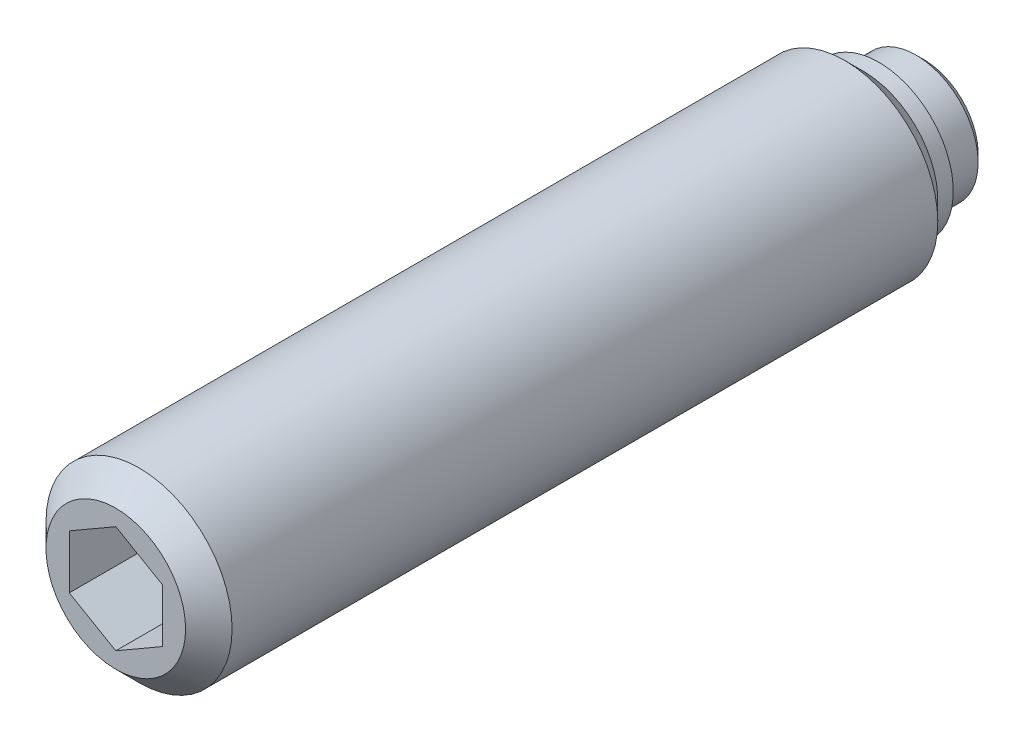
ISO-10303-21;
HEADER;
FILE_DESCRIPTION(('STEP AP214'),'2;1');
FILE_NAME('part.step','',(''),(''),'','','');
FILE_SCHEMA(('AUTOMOTIVE_DESIGN { 1 0 10303 214 1 1 1 1 }'));
ENDSEC;
DATA;
#1=APPLICATION_CONTEXT('core data for automotive mechanical design processes');
#2=APPLICATION_PROTOCOL_DEFINITION('international standard','automotive_design',2000,#1);
#3=PRODUCT_CONTEXT('',#1,'mechanical');
#4=PRODUCT('Part','Part','',(#3));
#5=PRODUCT_RELATED_PRODUCT_CATEGORY('part','',(#4));
#6=PRODUCT_DEFINITION_FORMATION('','',#4);
#7=PRODUCT_DEFINITION_CONTEXT('part definition',#1,'design');
#8=PRODUCT_DEFINITION('design','',#6,#7);
#9=PRODUCT_DEFINITION_SHAPE('','',#8);
#10=(LENGTH_UNIT() NAMED_UNIT(*) SI_UNIT(.MILLI.,.METRE.));
#11=(NAMED_UNIT(*) PLANE_ANGLE_UNIT() SI_UNIT($,.RADIAN.));
#12=(NAMED_UNIT(*) SI_UNIT($,.STERADIAN.) SOLID_ANGLE_UNIT());
#13=UNCERTAINTY_MEASURE_WITH_UNIT(LENGTH_MEASURE(1.E-05),#10,'distance_accuracy_value','');
#14=(GEOMETRIC_REPRESENTATION_CONTEXT(3) GLOBAL_UNCERTAINTY_ASSIGNED_CONTEXT((#13)) GLOBAL_UNIT_ASSIGNED_CONTEXT((#10,
#11,#12)) REPRESENTATION_CONTEXT('',''));
#15=CARTESIAN_POINT('',(0.,0.,0.));
#16=DIRECTION('',(0.,0.,1.));
#17=DIRECTION('',(1.,0.,0.));
#18=AXIS2_PLACEMENT_3D('',#15,#16,#17);
#19=CARTESIAN_POINT('',(0.,0.,0.));
#20=DIRECTION('',(0.,0.,-1.));
#21=DIRECTION('',(-1.,0.,0.));
#22=AXIS2_PLACEMENT_3D('',#19,#20,#21);
#23=CYLINDRICAL_SURFACE('',#22,4.);
#24=CARTESIAN_POINT('',(0.,0.,0.5));
#25=DIRECTION('',(0.,0.,-1.));
#26=DIRECTION('',(-1.,0.,0.));
#27=AXIS2_PLACEMENT_3D('',#24,#25,#26);
#28=CIRCLE('',#27,4.);
#29=CARTESIAN_POINT('',(-4.,0.,0.5));
#30=VERTEX_POINT('',#29);
#31=EDGE_CURVE('E133',#30,#30,#28,.T.);
#32=ORIENTED_EDGE('',*,*,#31,.F.);
#33=EDGE_LOOP('',(#32));
#34=FACE_BOUND('',#33,.T.);
#35=CARTESIAN_POINT('',(0.,0.,2.9));
#36=DIRECTION('',(0.,0.,-1.));
#37=DIRECTION('',(-1.,0.,0.));
#38=AXIS2_PLACEMENT_3D('',#35,#36,#37);
#39=CIRCLE('',#38,4.);
#40=CARTESIAN_POINT('',(-4.,0.,2.9));
#41=VERTEX_POINT('',#40);
#42=EDGE_CURVE('E127',#41,#41,#39,.T.);
#43=ORIENTED_EDGE('',*,*,#42,.T.);
#44=EDGE_LOOP('',(#43));
#45=FACE_BOUND('',#44,.T.);
#46=ADVANCED_FACE('F14',(#34,#45),#23,.T.);
#47=CARTESIAN_POINT('',(0.,0.,0.5));
#48=DIRECTION('',(0.,0.,1.));
#49=DIRECTION('',(1.,0.,0.));
#50=AXIS2_PLACEMENT_3D('',#47,#48,#49);
#51=CONICAL_SURFACE('',#50,4.,0.785398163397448);
#52=CARTESIAN_POINT('',(0.,0.,0.));
#53=DIRECTION('',(0.,0.,-1.));
#54=DIRECTION('',(-1.,0.,0.));
#55=AXIS2_PLACEMENT_3D('',#52,#53,#54);
#56=CIRCLE('',#55,3.5);
#57=CARTESIAN_POINT('',(-3.5,0.,0.));
#58=VERTEX_POINT('',#57);
#59=EDGE_CURVE('E130',#58,#58,#56,.T.);
#60=ORIENTED_EDGE('',*,*,#59,.F.);
#61=EDGE_LOOP('',(#60));
#62=FACE_BOUND('',#61,.T.);
#63=ORIENTED_EDGE('',*,*,#31,.T.);
#64=EDGE_LOOP('',(#63));
#65=FACE_BOUND('',#64,.T.);
#66=ADVANCED_FACE('F159',(#62,#65),#51,.T.);
#67=CARTESIAN_POINT('',(0.,3.5,0.));
#68=DIRECTION('',(0.,0.,1.));
#69=DIRECTION('',(1.,0.,0.));
#70=AXIS2_PLACEMENT_3D('',#67,#68,#69);
#71=PLANE('',#70);
#72=ORIENTED_EDGE('',*,*,#59,.T.);
#73=EDGE_LOOP('',(#72));
#74=FACE_BOUND('',#73,.T.);
#75=ADVANCED_FACE('F165',(#74),#71,.F.);
#76=CARTESIAN_POINT('',(0.,0.,2.9));
#77=DIRECTION('',(0.,0.,-1.));
#78=DIRECTION('',(-1.,0.,0.));
#79=AXIS2_PLACEMENT_3D('',#76,#77,#78);
#80=CYLINDRICAL_SURFACE('',#79,6.);
#81=CARTESIAN_POINT('',(0.,0.,5.1));
#82=DIRECTION('',(0.,0.,-1.));
#83=DIRECTION('',(-1.,0.,0.));
#84=AXIS2_PLACEMENT_3D('',#81,#82,#83);
#85=CIRCLE('',#84,6.);
#86=CARTESIAN_POINT('',(-6.,0.,5.1));
#87=VERTEX_POINT('',#86);
#88=EDGE_CURVE('E9',#87,#87,#85,.T.);
#89=ORIENTED_EDGE('',*,*,#88,.F.);
#90=EDGE_LOOP('',(#89));
#91=FACE_BOUND('',#90,.T.);
#92=CARTESIAN_POINT('',(0.,0.,50.6));
#93=DIRECTION('',(0.,0.,1.));
#94=DIRECTION('',(1.,0.,0.));
#95=AXIS2_PLACEMENT_3D('',#92,#93,#94);
#96=CIRCLE('',#95,6.);
#97=CARTESIAN_POINT('',(6.,0.,50.6));
#98=VERTEX_POINT('',#97);
#99=EDGE_CURVE('E124',#98,#98,#96,.T.);
#100=ORIENTED_EDGE('',*,*,#99,.F.);
#101=EDGE_LOOP('',(#100));
#102=FACE_BOUND('',#101,.T.);
#103=ADVANCED_FACE('F16',(#91,#102),#80,.T.);
#104=CARTESIAN_POINT('',(0.,4.8,2.9));
#105=DIRECTION('',(0.,0.,1.));
#106=DIRECTION('',(1.,0.,0.));
#107=AXIS2_PLACEMENT_3D('',#104,#105,#106);
#108=PLANE('',#107);
#109=CARTESIAN_POINT('',(0.,0.,2.9));
#110=DIRECTION('',(0.,0.,-1.));
#111=DIRECTION('',(-1.,0.,0.));
#112=AXIS2_PLACEMENT_3D('',#109,#110,#111);
#113=CIRCLE('',#112,4.8);
#114=CARTESIAN_POINT('',(-4.8,0.,2.9));
#115=VERTEX_POINT('',#114);
#116=EDGE_CURVE('E136',#115,#115,#113,.T.);
#117=ORIENTED_EDGE('',*,*,#116,.T.);
#118=EDGE_LOOP('',(#117));
#119=FACE_BOUND('',#118,.T.);
#120=ORIENTED_EDGE('',*,*,#42,.F.);
#121=EDGE_LOOP('',(#120));
#122=FACE_BOUND('',#121,.T.);
#123=ADVANCED_FACE('F156',(#119,#122),#108,.F.);
#124=CARTESIAN_POINT('',(0.,0.,2.9));
#125=DIRECTION('',(0.,0.,-1.));
#126=DIRECTION('',(-1.,0.,0.));
#127=AXIS2_PLACEMENT_3D('',#124,#125,#126);
#128=CYLINDRICAL_SURFACE('',#127,4.8);
#129=CARTESIAN_POINT('',(0.,0.,3.9));
#130=DIRECTION('',(0.,0.,-1.));
#131=DIRECTION('',(-1.,0.,0.));
#132=AXIS2_PLACEMENT_3D('',#129,#130,#131);
#133=CIRCLE('',#132,4.8);
#134=CARTESIAN_POINT('',(-4.8,0.,3.9));
#135=VERTEX_POINT('',#134);
#136=EDGE_CURVE('E22',#135,#135,#133,.T.);
#137=ORIENTED_EDGE('',*,*,#136,.T.);
#138=EDGE_LOOP('',(#137));
#139=FACE_BOUND('',#138,.T.);
#140=ORIENTED_EDGE('',*,*,#116,.F.);
#141=EDGE_LOOP('',(#140));
#142=FACE_BOUND('',#141,.T.);
#143=ADVANCED_FACE('F141',(#139,#142),#128,.T.);
#144=CARTESIAN_POINT('',(0.,0.,5.1));
#145=DIRECTION('',(0.,0.,1.));
#146=DIRECTION('',(1.,0.,0.));
#147=AXIS2_PLACEMENT_3D('',#144,#145,#146);
#148=CONICAL_SURFACE('',#147,6.,0.785398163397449);
#149=ORIENTED_EDGE('',*,*,#88,.T.);
#150=EDGE_LOOP('',(#149));
#151=FACE_BOUND('',#150,.T.);
#152=ORIENTED_EDGE('',*,*,#136,.F.);
#153=EDGE_LOOP('',(#152));
#154=FACE_BOUND('',#153,.T.);
#155=ADVANCED_FACE('F144',(#151,#154),#148,.T.);
#156=CARTESIAN_POINT('',(0.,-4.5,52.1));
#157=DIRECTION('',(0.,0.,1.));
#158=DIRECTION('',(1.,0.,0.));
#159=AXIS2_PLACEMENT_3D('',#156,#157,#158);
#160=PLANE('',#159);
#161=DIRECTION('',(0.866025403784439,-0.5,0.));
#162=VECTOR('',#161,1.);
#163=CARTESIAN_POINT('',(-3.,-1.73205080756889,52.1));
#164=LINE('',#163,#162);
#165=CARTESIAN_POINT('',(-3.,-1.73205080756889,52.1));
#166=VERTEX_POINT('',#165);
#167=CARTESIAN_POINT('',(0.,-3.46410161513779,52.1));
#168=VERTEX_POINT('',#167);
#169=EDGE_CURVE('E29',#166,#168,#164,.T.);
#170=ORIENTED_EDGE('',*,*,#169,.F.);
#171=DIRECTION('',(0.,-1.,0.));
#172=VECTOR('',#171,1.);
#173=CARTESIAN_POINT('',(-3.,1.73205080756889,52.1));
#174=LINE('',#173,#172);
#175=CARTESIAN_POINT('',(-3.,1.73205080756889,52.1));
#176=VERTEX_POINT('',#175);
#177=EDGE_CURVE('E112',#176,#166,#174,.T.);
#178=ORIENTED_EDGE('',*,*,#177,.F.);
#179=DIRECTION('',(-0.866025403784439,-0.5,0.));
#180=VECTOR('',#179,1.);
#181=CARTESIAN_POINT('',(0.,3.46410161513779,52.1));
#182=LINE('',#181,#180);
#183=CARTESIAN_POINT('',(0.,3.46410161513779,52.1));
#184=VERTEX_POINT('',#183);
#185=EDGE_CURVE('E110',#184,#176,#182,.T.);
#186=ORIENTED_EDGE('',*,*,#185,.F.);
#187=DIRECTION('',(-0.866025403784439,0.5,0.));
#188=VECTOR('',#187,1.);
#189=CARTESIAN_POINT('',(3.,1.73205080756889,52.1));
#190=LINE('',#189,#188);
#191=CARTESIAN_POINT('',(3.,1.73205080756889,52.1));
#192=VERTEX_POINT('',#191);
#193=EDGE_CURVE('E77',#192,#184,#190,.T.);
#194=ORIENTED_EDGE('',*,*,#193,.F.);
#195=DIRECTION('',(0.,1.,0.));
#196=VECTOR('',#195,1.);
#197=CARTESIAN_POINT('',(3.,-1.73205080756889,52.1));
#198=LINE('',#197,#196);
#199=CARTESIAN_POINT('',(3.,-1.73205080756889,52.1));
#200=VERTEX_POINT('',#199);
#201=EDGE_CURVE('E106',#200,#192,#198,.T.);
#202=ORIENTED_EDGE('',*,*,#201,.F.);
#203=DIRECTION('',(0.866025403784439,0.5,0.));
#204=VECTOR('',#203,1.);
#205=CARTESIAN_POINT('',(0.,-3.46410161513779,52.1));
#206=LINE('',#205,#204);
#207=EDGE_CURVE('E103',#168,#200,#206,.T.);
#208=ORIENTED_EDGE('',*,*,#207,.F.);
#209=EDGE_LOOP('',(#170,#178,#186,#194,#202,#208));
#210=FACE_BOUND('',#209,.T.);
#211=CARTESIAN_POINT('',(0.,0.,52.1));
#212=DIRECTION('',(0.,0.,1.));
#213=DIRECTION('',(1.,0.,0.));
#214=AXIS2_PLACEMENT_3D('',#211,#212,#213);
#215=CIRCLE('',#214,4.5);
#216=CARTESIAN_POINT('',(4.5,0.,52.1));
#217=VERTEX_POINT('',#216);
#218=EDGE_CURVE('E116',#217,#217,#215,.T.);
#219=ORIENTED_EDGE('',*,*,#218,.T.);
#220=EDGE_LOOP('',(#219));
#221=FACE_BOUND('',#220,.T.);
#222=ADVANCED_FACE('F146',(#210,#221),#160,.T.);
#223=CARTESIAN_POINT('',(0.,0.,52.1));
#224=DIRECTION('',(0.,0.,-1.));
#225=DIRECTION('',(-1.,0.,0.));
#226=AXIS2_PLACEMENT_3D('',#223,#224,#225);
#227=CONICAL_SURFACE('',#226,4.5,0.78539816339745);
#228=ORIENTED_EDGE('',*,*,#99,.T.);
#229=EDGE_LOOP('',(#228));
#230=FACE_BOUND('',#229,.T.);
#231=ORIENTED_EDGE('',*,*,#218,.F.);
#232=EDGE_LOOP('',(#231));
#233=FACE_BOUND('',#232,.T.);
#234=ADVANCED_FACE('F153',(#230,#233),#227,.T.);
#235=CARTESIAN_POINT('',(-3.,-1.73205080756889,44.1));
#236=DIRECTION('',(-0.5,-0.866025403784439,0.));
#237=DIRECTION('',(0.866025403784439,-0.5,0.));
#238=AXIS2_PLACEMENT_3D('',#235,#236,#237);
#239=PLANE('',#238);
#240=ORIENTED_EDGE('',*,*,#169,.T.);
#241=DIRECTION('',(0.,0.,1.));
#242=VECTOR('',#241,1.);
#243=CARTESIAN_POINT('',(0.,-3.46410161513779,44.1));
#244=LINE('',#243,#242);
#245=CARTESIAN_POINT('',(0.,-3.46410161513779,44.1));
#246=VERTEX_POINT('',#245);
#247=EDGE_CURVE('E59',#246,#168,#244,.T.);
#248=ORIENTED_EDGE('',*,*,#247,.F.);
#249=DIRECTION('',(0.866025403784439,-0.5,0.));
#250=VECTOR('',#249,1.);
#251=CARTESIAN_POINT('',(-3.,-1.73205080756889,44.1));
#252=LINE('',#251,#250);
#253=CARTESIAN_POINT('',(-3.,-1.73205080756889,44.1));
#254=VERTEX_POINT('',#253);
#255=EDGE_CURVE('E114',#254,#246,#252,.T.);
#256=ORIENTED_EDGE('',*,*,#255,.F.);
#257=DIRECTION('',(0.,0.,1.));
#258=VECTOR('',#257,1.);
#259=CARTESIAN_POINT('',(-3.,-1.73205080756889,44.1));
#260=LINE('',#259,#258);
#261=EDGE_CURVE('E37',#254,#166,#260,.T.);
#262=ORIENTED_EDGE('',*,*,#261,.T.);
#263=EDGE_LOOP('',(#240,#248,#256,#262));
#264=FACE_BOUND('',#263,.T.);
#265=ADVANCED_FACE('F191',(#264),#239,.F.);
#266=CARTESIAN_POINT('',(-3.,1.73205080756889,44.1));
#267=DIRECTION('',(-1.,0.,0.));
#268=DIRECTION('',(0.,0.,1.));
#269=AXIS2_PLACEMENT_3D('',#266,#267,#268);
#270=PLANE('',#269);
#271=ORIENTED_EDGE('',*,*,#177,.T.);
#272=ORIENTED_EDGE('',*,*,#261,.F.);
#273=DIRECTION('',(0.,-1.,0.));
#274=VECTOR('',#273,1.);
#275=CARTESIAN_POINT('',(-3.,1.73205080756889,44.1));
#276=LINE('',#275,#274);
#277=CARTESIAN_POINT('',(-3.,1.73205080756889,44.1));
#278=VERTEX_POINT('',#277);
#279=EDGE_CURVE('E89',#278,#254,#276,.T.);
#280=ORIENTED_EDGE('',*,*,#279,.F.);
#281=DIRECTION('',(0.,0.,1.));
#282=VECTOR('',#281,1.);
#283=CARTESIAN_POINT('',(-3.,1.73205080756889,44.1));
#284=LINE('',#283,#282);
#285=EDGE_CURVE('E81',#278,#176,#284,.T.);
#286=ORIENTED_EDGE('',*,*,#285,.T.);
#287=EDGE_LOOP('',(#271,#272,#280,#286));
#288=FACE_BOUND('',#287,.T.);
#289=ADVANCED_FACE('F198',(#288),#270,.F.);
#290=CARTESIAN_POINT('',(0.,3.46410161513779,44.1));
#291=DIRECTION('',(-0.5,0.866025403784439,0.));
#292=DIRECTION('',(-0.866025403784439,-0.5,0.));
#293=AXIS2_PLACEMENT_3D('',#290,#291,#292);
#294=PLANE('',#293);
#295=ORIENTED_EDGE('',*,*,#185,.T.);
#296=ORIENTED_EDGE('',*,*,#285,.F.);
#297=DIRECTION('',(-0.866025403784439,-0.5,0.));
#298=VECTOR('',#297,1.);
#299=CARTESIAN_POINT('',(0.,3.46410161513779,44.1));
#300=LINE('',#299,#298);
#301=CARTESIAN_POINT('',(0.,3.46410161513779,44.1));
#302=VERTEX_POINT('',#301);
#303=EDGE_CURVE('E85',#302,#278,#300,.T.);
#304=ORIENTED_EDGE('',*,*,#303,.F.);
#305=DIRECTION('',(0.,0.,1.));
#306=VECTOR('',#305,1.);
#307=CARTESIAN_POINT('',(0.,3.46410161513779,44.1));
#308=LINE('',#307,#306);
#309=EDGE_CURVE('E70',#302,#184,#308,.T.);
#310=ORIENTED_EDGE('',*,*,#309,.T.);
#311=EDGE_LOOP('',(#295,#296,#304,#310));
#312=FACE_BOUND('',#311,.T.);
#313=ADVANCED_FACE('F86',(#312),#294,.F.);
#314=CARTESIAN_POINT('',(3.,1.73205080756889,44.1));
#315=DIRECTION('',(0.5,0.866025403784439,0.));
#316=DIRECTION('',(-0.866025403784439,0.5,0.));
#317=AXIS2_PLACEMENT_3D('',#314,#315,#316);
#318=PLANE('',#317);
#319=ORIENTED_EDGE('',*,*,#193,.T.);
#320=ORIENTED_EDGE('',*,*,#309,.F.);
#321=DIRECTION('',(-0.866025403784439,0.5,0.));
#322=VECTOR('',#321,1.);
#323=CARTESIAN_POINT('',(3.,1.73205080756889,44.1));
#324=LINE('',#323,#322);
#325=CARTESIAN_POINT('',(3.,1.73205080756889,44.1));
#326=VERTEX_POINT('',#325);
#327=EDGE_CURVE('E74',#326,#302,#324,.T.);
#328=ORIENTED_EDGE('',*,*,#327,.F.);
#329=DIRECTION('',(0.,0.,1.));
#330=VECTOR('',#329,1.);
#331=CARTESIAN_POINT('',(3.,1.73205080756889,44.1));
#332=LINE('',#331,#330);
#333=EDGE_CURVE('E82',#326,#192,#332,.T.);
#334=ORIENTED_EDGE('',*,*,#333,.T.);
#335=EDGE_LOOP('',(#319,#320,#328,#334));
#336=FACE_BOUND('',#335,.T.);
#337=ADVANCED_FACE('F72',(#336),#318,.F.);
#338=CARTESIAN_POINT('',(3.,-1.73205080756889,44.1));
#339=DIRECTION('',(1.,0.,0.));
#340=DIRECTION('',(0.,0.,-1.));
#341=AXIS2_PLACEMENT_3D('',#338,#339,#340);
#342=PLANE('',#341);
#343=ORIENTED_EDGE('',*,*,#201,.T.);
#344=ORIENTED_EDGE('',*,*,#333,.F.);
#345=DIRECTION('',(0.,1.,0.));
#346=VECTOR('',#345,1.);
#347=CARTESIAN_POINT('',(3.,-1.73205080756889,44.1));
#348=LINE('',#347,#346);
#349=CARTESIAN_POINT('',(3.,-1.73205080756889,44.1));
#350=VERTEX_POINT('',#349);
#351=EDGE_CURVE('E95',#350,#326,#348,.T.);
#352=ORIENTED_EDGE('',*,*,#351,.F.);
#353=DIRECTION('',(0.,0.,1.));
#354=VECTOR('',#353,1.);
#355=CARTESIAN_POINT('',(3.,-1.73205080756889,44.1));
#356=LINE('',#355,#354);
#357=EDGE_CURVE('E119',#350,#200,#356,.T.);
#358=ORIENTED_EDGE('',*,*,#357,.T.);
#359=EDGE_LOOP('',(#343,#344,#352,#358));
#360=FACE_BOUND('',#359,.T.);
#361=ADVANCED_FACE('F204',(#360),#342,.F.);
#362=CARTESIAN_POINT('',(0.,-3.46410161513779,44.1));
#363=DIRECTION('',(0.5,-0.866025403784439,0.));
#364=DIRECTION('',(0.866025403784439,0.5,0.));
#365=AXIS2_PLACEMENT_3D('',#362,#363,#364);
#366=PLANE('',#365);
#367=ORIENTED_EDGE('',*,*,#207,.T.);
#368=ORIENTED_EDGE('',*,*,#357,.F.);
#369=DIRECTION('',(0.866025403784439,0.5,0.));
#370=VECTOR('',#369,1.);
#371=CARTESIAN_POINT('',(0.,-3.46410161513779,44.1));
#372=LINE('',#371,#370);
#373=EDGE_CURVE('E97',#246,#350,#372,.T.);
#374=ORIENTED_EDGE('',*,*,#373,.F.);
#375=ORIENTED_EDGE('',*,*,#247,.T.);
#376=EDGE_LOOP('',(#367,#368,#374,#375));
#377=FACE_BOUND('',#376,.T.);
#378=ADVANCED_FACE('F201',(#377),#366,.F.);
#379=CARTESIAN_POINT('',(0.,0.,44.1));
#380=DIRECTION('',(0.,0.,1.));
#381=DIRECTION('',(1.,0.,0.));
#382=AXIS2_PLACEMENT_3D('',#379,#380,#381);
#383=PLANE('',#382);
#384=ORIENTED_EDGE('',*,*,#255,.T.);
#385=ORIENTED_EDGE('',*,*,#373,.T.);
#386=ORIENTED_EDGE('',*,*,#351,.T.);
#387=ORIENTED_EDGE('',*,*,#327,.T.);
#388=ORIENTED_EDGE('',*,*,#303,.T.);
#389=ORIENTED_EDGE('',*,*,#279,.T.);
#390=EDGE_LOOP('',(#384,#385,#386,#387,#388,#389));
#391=FACE_BOUND('',#390,.T.);
#392=ADVANCED_FACE('F92',(#391),#383,.T.);
#393=CLOSED_SHELL('',(#46,#66,#75,#103,#123,#143,#155,#222,#234,#265,#289,#313,#337,#361,#378,#392));
#394=MANIFOLD_SOLID_BREP('B1',#393);
#395=ADVANCED_BREP_SHAPE_REPRESENTATION('',(#18,#394),#14);
#396=SHAPE_DEFINITION_REPRESENTATION(#9,#395);
ENDSEC;
END-ISO-10303-21;
